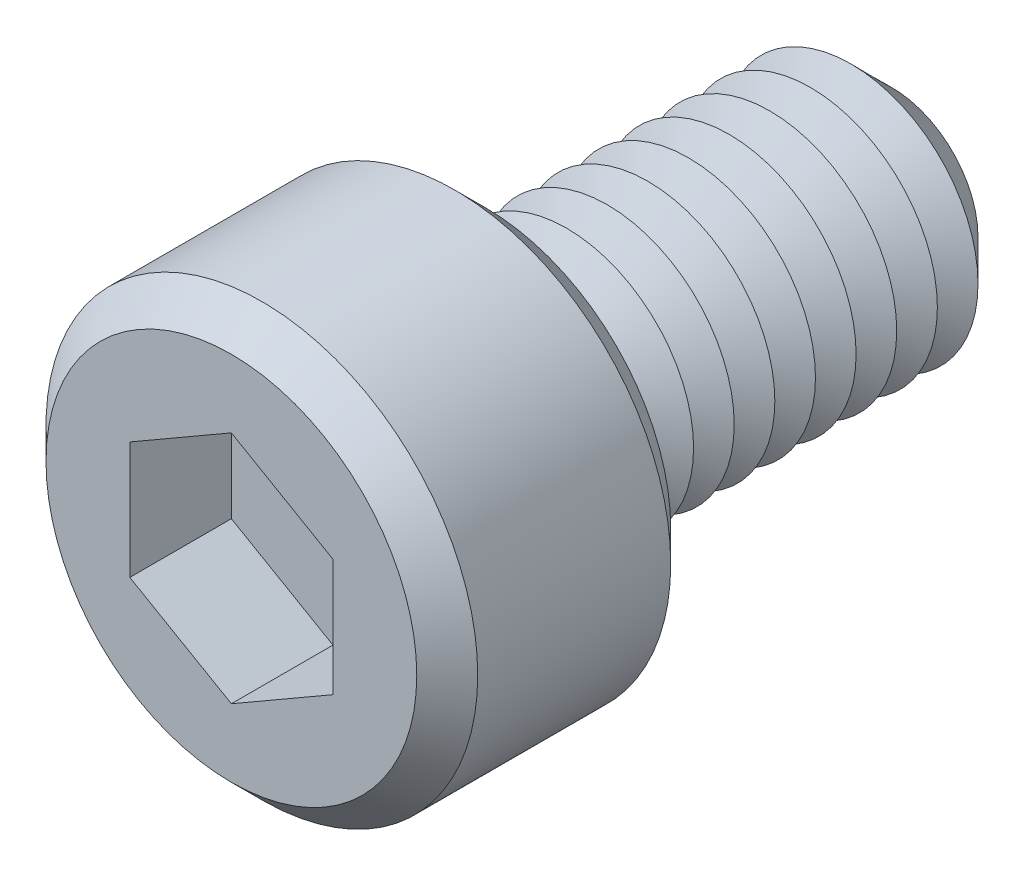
ISO-10303-21;
HEADER;
FILE_DESCRIPTION(('STEP AP214'),'2;1');
FILE_NAME('part.step','',(''),(''),'','','');
FILE_SCHEMA(('AUTOMOTIVE_DESIGN { 1 0 10303 214 1 1 1 1 }'));
ENDSEC;
DATA;
#1=APPLICATION_CONTEXT('core data for automotive mechanical design processes');
#2=APPLICATION_PROTOCOL_DEFINITION('international standard','automotive_design',2000,#1);
#3=PRODUCT_CONTEXT('',#1,'mechanical');
#4=PRODUCT('Part','Part','',(#3));
#5=PRODUCT_RELATED_PRODUCT_CATEGORY('part','',(#4));
#6=PRODUCT_DEFINITION_FORMATION('','',#4);
#7=PRODUCT_DEFINITION_CONTEXT('part definition',#1,'design');
#8=PRODUCT_DEFINITION('design','',#6,#7);
#9=PRODUCT_DEFINITION_SHAPE('','',#8);
#10=(LENGTH_UNIT() NAMED_UNIT(*) SI_UNIT(.MILLI.,.METRE.));
#11=(NAMED_UNIT(*) PLANE_ANGLE_UNIT() SI_UNIT($,.RADIAN.));
#12=(NAMED_UNIT(*) SI_UNIT($,.STERADIAN.) SOLID_ANGLE_UNIT());
#13=UNCERTAINTY_MEASURE_WITH_UNIT(LENGTH_MEASURE(1.E-05),#10,'distance_accuracy_value','');
#14=(GEOMETRIC_REPRESENTATION_CONTEXT(3) GLOBAL_UNCERTAINTY_ASSIGNED_CONTEXT((#13)) GLOBAL_UNIT_ASSIGNED_CONTEXT((#10,
#11,#12)) REPRESENTATION_CONTEXT('',''));
#15=CARTESIAN_POINT('',(0.,0.,0.));
#16=DIRECTION('',(0.,0.,1.));
#17=DIRECTION('',(1.,0.,0.));
#18=AXIS2_PLACEMENT_3D('',#15,#16,#17);
#19=CARTESIAN_POINT('',(0.,0.,5.));
#20=DIRECTION('',(0.,0.,-1.));
#21=DIRECTION('',(-1.,0.,0.));
#22=AXIS2_PLACEMENT_3D('',#19,#20,#21);
#23=CYLINDRICAL_SURFACE('',#22,4.25);
#24=CARTESIAN_POINT('',(0.,0.,0.600000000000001));
#25=DIRECTION('',(0.,0.,1.));
#26=DIRECTION('',(1.,0.,0.));
#27=AXIS2_PLACEMENT_3D('',#24,#25,#26);
#28=CIRCLE('',#27,4.25);
#29=CARTESIAN_POINT('',(4.25,0.,0.600000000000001));
#30=VERTEX_POINT('',#29);
#31=EDGE_CURVE('E248',#30,#30,#28,.T.);
#32=ORIENTED_EDGE('',*,*,#31,.T.);
#33=EDGE_LOOP('',(#32));
#34=FACE_BOUND('',#33,.T.);
#35=CARTESIAN_POINT('',(0.,0.,4.4));
#36=DIRECTION('',(0.,0.,1.));
#37=DIRECTION('',(1.,0.,0.));
#38=AXIS2_PLACEMENT_3D('',#35,#36,#37);
#39=CIRCLE('',#38,4.25);
#40=CARTESIAN_POINT('',(4.25,0.,4.4));
#41=VERTEX_POINT('',#40);
#42=EDGE_CURVE('E244',#41,#41,#39,.F.);
#43=ORIENTED_EDGE('',*,*,#42,.T.);
#44=EDGE_LOOP('',(#43));
#45=FACE_BOUND('',#44,.T.);
#46=ADVANCED_FACE('F39',(#34,#45),#23,.T.);
#47=CARTESIAN_POINT('',(0.,0.,5.));
#48=DIRECTION('',(0.,0.,1.));
#49=DIRECTION('',(1.,0.,0.));
#50=AXIS2_PLACEMENT_3D('',#47,#48,#49);
#51=PLANE('',#50);
#52=CARTESIAN_POINT('',(0.,0.,5.));
#53=DIRECTION('',(0.,0.,1.));
#54=DIRECTION('',(1.,0.,0.));
#55=AXIS2_PLACEMENT_3D('',#52,#53,#54);
#56=CIRCLE('',#55,3.65);
#57=CARTESIAN_POINT('',(3.65,0.,5.));
#58=VERTEX_POINT('',#57);
#59=EDGE_CURVE('E11',#58,#58,#56,.T.);
#60=ORIENTED_EDGE('',*,*,#59,.T.);
#61=EDGE_LOOP('',(#60));
#62=FACE_BOUND('',#61,.T.);
#63=DIRECTION('',(-0.866025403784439,0.5,0.));
#64=VECTOR('',#63,1.);
#65=CARTESIAN_POINT('',(2.,1.15470053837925,5.));
#66=LINE('',#65,#64);
#67=CARTESIAN_POINT('',(2.,1.15470053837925,5.));
#68=VERTEX_POINT('',#67);
#69=CARTESIAN_POINT('',(0.,2.3094010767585,5.));
#70=VERTEX_POINT('',#69);
#71=EDGE_CURVE('E55',#68,#70,#66,.T.);
#72=ORIENTED_EDGE('',*,*,#71,.F.);
#73=DIRECTION('',(0.,1.,0.));
#74=VECTOR('',#73,1.);
#75=CARTESIAN_POINT('',(2.,-1.15470053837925,5.));
#76=LINE('',#75,#74);
#77=CARTESIAN_POINT('',(2.,-1.15470053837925,5.));
#78=VERTEX_POINT('',#77);
#79=EDGE_CURVE('E151',#78,#68,#76,.T.);
#80=ORIENTED_EDGE('',*,*,#79,.F.);
#81=DIRECTION('',(0.866025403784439,0.5,0.));
#82=VECTOR('',#81,1.);
#83=CARTESIAN_POINT('',(0.,-2.3094010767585,5.));
#84=LINE('',#83,#82);
#85=CARTESIAN_POINT('',(0.,-2.3094010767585,5.));
#86=VERTEX_POINT('',#85);
#87=EDGE_CURVE('E148',#86,#78,#84,.T.);
#88=ORIENTED_EDGE('',*,*,#87,.F.);
#89=DIRECTION('',(0.866025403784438,-0.5,0.));
#90=VECTOR('',#89,1.);
#91=CARTESIAN_POINT('',(-2.,-1.15470053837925,5.));
#92=LINE('',#91,#90);
#93=CARTESIAN_POINT('',(-2.,-1.15470053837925,5.));
#94=VERTEX_POINT('',#93);
#95=EDGE_CURVE('E103',#94,#86,#92,.T.);
#96=ORIENTED_EDGE('',*,*,#95,.F.);
#97=DIRECTION('',(0.,-1.,0.));
#98=VECTOR('',#97,1.);
#99=CARTESIAN_POINT('',(-2.,1.15470053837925,5.));
#100=LINE('',#99,#98);
#101=CARTESIAN_POINT('',(-2.,1.15470053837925,5.));
#102=VERTEX_POINT('',#101);
#103=EDGE_CURVE('E142',#102,#94,#100,.T.);
#104=ORIENTED_EDGE('',*,*,#103,.F.);
#105=DIRECTION('',(-0.866025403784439,-0.5,0.));
#106=VECTOR('',#105,1.);
#107=CARTESIAN_POINT('',(0.,2.3094010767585,5.));
#108=LINE('',#107,#106);
#109=EDGE_CURVE('E137',#70,#102,#108,.T.);
#110=ORIENTED_EDGE('',*,*,#109,.F.);
#111=EDGE_LOOP('',(#72,#80,#88,#96,#104,#110));
#112=FACE_BOUND('',#111,.T.);
#113=ADVANCED_FACE('F266',(#62,#112),#51,.T.);
#114=CARTESIAN_POINT('',(0.,0.,0.));
#115=DIRECTION('',(0.,0.,1.));
#116=DIRECTION('',(1.,0.,0.));
#117=AXIS2_PLACEMENT_3D('',#114,#115,#116);
#118=PLANE('',#117);
#119=CARTESIAN_POINT('',(0.,0.,0.));
#120=DIRECTION('',(0.,0.,1.));
#121=DIRECTION('',(1.,0.,0.));
#122=AXIS2_PLACEMENT_3D('',#119,#120,#121);
#123=CIRCLE('',#122,3.65);
#124=CARTESIAN_POINT('',(3.65,0.,0.));
#125=VERTEX_POINT('',#124);
#126=EDGE_CURVE('E48',#125,#125,#123,.F.);
#127=ORIENTED_EDGE('',*,*,#126,.T.);
#128=EDGE_LOOP('',(#127));
#129=FACE_BOUND('',#128,.T.);
#130=CARTESIAN_POINT('',(0.,0.,0.));
#131=DIRECTION('',(0.,0.,1.));
#132=DIRECTION('',(1.,0.,0.));
#133=AXIS2_PLACEMENT_3D('',#130,#131,#132);
#134=CIRCLE('',#133,2.5);
#135=CARTESIAN_POINT('',(2.5,0.,0.));
#136=VERTEX_POINT('',#135);
#137=EDGE_CURVE('E237',#136,#136,#134,.T.);
#138=ORIENTED_EDGE('',*,*,#137,.T.);
#139=EDGE_LOOP('',(#138));
#140=FACE_BOUND('',#139,.T.);
#141=ADVANCED_FACE('F255',(#129,#140),#118,.F.);
#142=CARTESIAN_POINT('',(0.,0.,0.));
#143=DIRECTION('',(0.,0.,1.));
#144=DIRECTION('',(1.,0.,0.));
#145=AXIS2_PLACEMENT_3D('',#142,#143,#144);
#146=CONICAL_SURFACE('',#145,2.5,1.0471975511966);
#147=CARTESIAN_POINT('',(0.,0.,-0.4));
#148=DIRECTION('',(0.,0.,1.));
#149=DIRECTION('',(1.,0.,0.));
#150=AXIS2_PLACEMENT_3D('',#147,#148,#149);
#151=CIRCLE('',#150,1.80717967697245);
#152=CARTESIAN_POINT('',(1.80717967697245,0.,-0.4));
#153=VERTEX_POINT('',#152);
#154=EDGE_CURVE('E233',#153,#153,#151,.T.);
#155=ORIENTED_EDGE('',*,*,#154,.T.);
#156=EDGE_LOOP('',(#155));
#157=FACE_BOUND('',#156,.T.);
#158=ORIENTED_EDGE('',*,*,#137,.F.);
#159=EDGE_LOOP('',(#158));
#160=FACE_BOUND('',#159,.T.);
#161=ADVANCED_FACE('F388',(#157,#160),#146,.T.);
#162=CARTESIAN_POINT('',(0.,0.,-0.4));
#163=DIRECTION('',(0.,0.,-1.));
#164=DIRECTION('',(-1.,0.,0.));
#165=AXIS2_PLACEMENT_3D('',#162,#163,#164);
#166=CONICAL_SURFACE('',#165,1.80717967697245,1.0471975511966);
#167=CARTESIAN_POINT('',(0.,0.,-0.8));
#168=DIRECTION('',(0.,0.,1.));
#169=DIRECTION('',(1.,0.,0.));
#170=AXIS2_PLACEMENT_3D('',#167,#168,#169);
#171=CIRCLE('',#170,2.5);
#172=CARTESIAN_POINT('',(2.5,0.,-0.8));
#173=VERTEX_POINT('',#172);
#174=EDGE_CURVE('E229',#173,#173,#171,.T.);
#175=ORIENTED_EDGE('',*,*,#174,.T.);
#176=EDGE_LOOP('',(#175));
#177=FACE_BOUND('',#176,.T.);
#178=ORIENTED_EDGE('',*,*,#154,.F.);
#179=EDGE_LOOP('',(#178));
#180=FACE_BOUND('',#179,.T.);
#181=ADVANCED_FACE('F384',(#177,#180),#166,.T.);
#182=CARTESIAN_POINT('',(0.,0.,-0.8));
#183=DIRECTION('',(0.,0.,1.));
#184=DIRECTION('',(1.,0.,0.));
#185=AXIS2_PLACEMENT_3D('',#182,#183,#184);
#186=CONICAL_SURFACE('',#185,2.5,1.0471975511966);
#187=CARTESIAN_POINT('',(0.,0.,-1.2));
#188=DIRECTION('',(0.,0.,1.));
#189=DIRECTION('',(1.,0.,0.));
#190=AXIS2_PLACEMENT_3D('',#187,#188,#189);
#191=CIRCLE('',#190,1.80717967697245);
#192=CARTESIAN_POINT('',(1.80717967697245,0.,-1.2));
#193=VERTEX_POINT('',#192);
#194=EDGE_CURVE('E225',#193,#193,#191,.T.);
#195=ORIENTED_EDGE('',*,*,#194,.T.);
#196=EDGE_LOOP('',(#195));
#197=FACE_BOUND('',#196,.T.);
#198=ORIENTED_EDGE('',*,*,#174,.F.);
#199=EDGE_LOOP('',(#198));
#200=FACE_BOUND('',#199,.T.);
#201=ADVANCED_FACE('F380',(#197,#200),#186,.T.);
#202=CARTESIAN_POINT('',(0.,0.,-1.2));
#203=DIRECTION('',(0.,0.,-1.));
#204=DIRECTION('',(-1.,0.,0.));
#205=AXIS2_PLACEMENT_3D('',#202,#203,#204);
#206=CONICAL_SURFACE('',#205,1.80717967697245,1.0471975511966);
#207=CARTESIAN_POINT('',(0.,0.,-1.6));
#208=DIRECTION('',(0.,0.,1.));
#209=DIRECTION('',(1.,0.,0.));
#210=AXIS2_PLACEMENT_3D('',#207,#208,#209);
#211=CIRCLE('',#210,2.5);
#212=CARTESIAN_POINT('',(2.5,0.,-1.6));
#213=VERTEX_POINT('',#212);
#214=EDGE_CURVE('E221',#213,#213,#211,.T.);
#215=ORIENTED_EDGE('',*,*,#214,.T.);
#216=EDGE_LOOP('',(#215));
#217=FACE_BOUND('',#216,.T.);
#218=ORIENTED_EDGE('',*,*,#194,.F.);
#219=EDGE_LOOP('',(#218));
#220=FACE_BOUND('',#219,.T.);
#221=ADVANCED_FACE('F376',(#217,#220),#206,.T.);
#222=CARTESIAN_POINT('',(0.,0.,-1.6));
#223=DIRECTION('',(0.,0.,1.));
#224=DIRECTION('',(1.,0.,0.));
#225=AXIS2_PLACEMENT_3D('',#222,#223,#224);
#226=CONICAL_SURFACE('',#225,2.5,1.0471975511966);
#227=CARTESIAN_POINT('',(0.,0.,-2.));
#228=DIRECTION('',(0.,0.,1.));
#229=DIRECTION('',(1.,0.,0.));
#230=AXIS2_PLACEMENT_3D('',#227,#228,#229);
#231=CIRCLE('',#230,1.80717967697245);
#232=CARTESIAN_POINT('',(1.80717967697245,0.,-2.));
#233=VERTEX_POINT('',#232);
#234=EDGE_CURVE('E217',#233,#233,#231,.T.);
#235=ORIENTED_EDGE('',*,*,#234,.T.);
#236=EDGE_LOOP('',(#235));
#237=FACE_BOUND('',#236,.T.);
#238=ORIENTED_EDGE('',*,*,#214,.F.);
#239=EDGE_LOOP('',(#238));
#240=FACE_BOUND('',#239,.T.);
#241=ADVANCED_FACE('F372',(#237,#240),#226,.T.);
#242=CARTESIAN_POINT('',(0.,0.,-2.));
#243=DIRECTION('',(0.,0.,-1.));
#244=DIRECTION('',(-1.,0.,0.));
#245=AXIS2_PLACEMENT_3D('',#242,#243,#244);
#246=CONICAL_SURFACE('',#245,1.80717967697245,1.0471975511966);
#247=CARTESIAN_POINT('',(0.,0.,-2.4));
#248=DIRECTION('',(0.,0.,1.));
#249=DIRECTION('',(1.,0.,0.));
#250=AXIS2_PLACEMENT_3D('',#247,#248,#249);
#251=CIRCLE('',#250,2.5);
#252=CARTESIAN_POINT('',(2.5,0.,-2.4));
#253=VERTEX_POINT('',#252);
#254=EDGE_CURVE('E213',#253,#253,#251,.T.);
#255=ORIENTED_EDGE('',*,*,#254,.T.);
#256=EDGE_LOOP('',(#255));
#257=FACE_BOUND('',#256,.T.);
#258=ORIENTED_EDGE('',*,*,#234,.F.);
#259=EDGE_LOOP('',(#258));
#260=FACE_BOUND('',#259,.T.);
#261=ADVANCED_FACE('F368',(#257,#260),#246,.T.);
#262=CARTESIAN_POINT('',(0.,0.,-2.4));
#263=DIRECTION('',(0.,0.,1.));
#264=DIRECTION('',(1.,0.,0.));
#265=AXIS2_PLACEMENT_3D('',#262,#263,#264);
#266=CONICAL_SURFACE('',#265,2.5,1.0471975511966);
#267=CARTESIAN_POINT('',(0.,0.,-2.8));
#268=DIRECTION('',(0.,0.,1.));
#269=DIRECTION('',(1.,0.,0.));
#270=AXIS2_PLACEMENT_3D('',#267,#268,#269);
#271=CIRCLE('',#270,1.80717967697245);
#272=CARTESIAN_POINT('',(1.80717967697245,0.,-2.8));
#273=VERTEX_POINT('',#272);
#274=EDGE_CURVE('E209',#273,#273,#271,.T.);
#275=ORIENTED_EDGE('',*,*,#274,.T.);
#276=EDGE_LOOP('',(#275));
#277=FACE_BOUND('',#276,.T.);
#278=ORIENTED_EDGE('',*,*,#254,.F.);
#279=EDGE_LOOP('',(#278));
#280=FACE_BOUND('',#279,.T.);
#281=ADVANCED_FACE('F364',(#277,#280),#266,.T.);
#282=CARTESIAN_POINT('',(0.,0.,-2.8));
#283=DIRECTION('',(0.,0.,-1.));
#284=DIRECTION('',(-1.,0.,0.));
#285=AXIS2_PLACEMENT_3D('',#282,#283,#284);
#286=CONICAL_SURFACE('',#285,1.80717967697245,1.0471975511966);
#287=CARTESIAN_POINT('',(0.,0.,-3.2));
#288=DIRECTION('',(0.,0.,1.));
#289=DIRECTION('',(1.,0.,0.));
#290=AXIS2_PLACEMENT_3D('',#287,#288,#289);
#291=CIRCLE('',#290,2.5);
#292=CARTESIAN_POINT('',(2.5,0.,-3.2));
#293=VERTEX_POINT('',#292);
#294=EDGE_CURVE('E205',#293,#293,#291,.T.);
#295=ORIENTED_EDGE('',*,*,#294,.T.);
#296=EDGE_LOOP('',(#295));
#297=FACE_BOUND('',#296,.T.);
#298=ORIENTED_EDGE('',*,*,#274,.F.);
#299=EDGE_LOOP('',(#298));
#300=FACE_BOUND('',#299,.T.);
#301=ADVANCED_FACE('F360',(#297,#300),#286,.T.);
#302=CARTESIAN_POINT('',(0.,0.,-3.2));
#303=DIRECTION('',(0.,0.,1.));
#304=DIRECTION('',(1.,0.,0.));
#305=AXIS2_PLACEMENT_3D('',#302,#303,#304);
#306=CONICAL_SURFACE('',#305,2.5,1.0471975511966);
#307=CARTESIAN_POINT('',(0.,0.,-3.6));
#308=DIRECTION('',(0.,0.,1.));
#309=DIRECTION('',(1.,0.,0.));
#310=AXIS2_PLACEMENT_3D('',#307,#308,#309);
#311=CIRCLE('',#310,1.80717967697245);
#312=CARTESIAN_POINT('',(1.80717967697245,0.,-3.6));
#313=VERTEX_POINT('',#312);
#314=EDGE_CURVE('E201',#313,#313,#311,.T.);
#315=ORIENTED_EDGE('',*,*,#314,.T.);
#316=EDGE_LOOP('',(#315));
#317=FACE_BOUND('',#316,.T.);
#318=ORIENTED_EDGE('',*,*,#294,.F.);
#319=EDGE_LOOP('',(#318));
#320=FACE_BOUND('',#319,.T.);
#321=ADVANCED_FACE('F356',(#317,#320),#306,.T.);
#322=CARTESIAN_POINT('',(0.,0.,-3.6));
#323=DIRECTION('',(0.,0.,-1.));
#324=DIRECTION('',(-1.,0.,0.));
#325=AXIS2_PLACEMENT_3D('',#322,#323,#324);
#326=CONICAL_SURFACE('',#325,1.80717967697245,1.0471975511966);
#327=CARTESIAN_POINT('',(0.,0.,-4.));
#328=DIRECTION('',(0.,0.,1.));
#329=DIRECTION('',(1.,0.,0.));
#330=AXIS2_PLACEMENT_3D('',#327,#328,#329);
#331=CIRCLE('',#330,2.5);
#332=CARTESIAN_POINT('',(2.5,0.,-4.));
#333=VERTEX_POINT('',#332);
#334=EDGE_CURVE('E198',#333,#333,#331,.T.);
#335=ORIENTED_EDGE('',*,*,#334,.T.);
#336=EDGE_LOOP('',(#335));
#337=FACE_BOUND('',#336,.T.);
#338=ORIENTED_EDGE('',*,*,#314,.F.);
#339=EDGE_LOOP('',(#338));
#340=FACE_BOUND('',#339,.T.);
#341=ADVANCED_FACE('F352',(#337,#340),#326,.T.);
#342=CARTESIAN_POINT('',(0.,0.,-4.));
#343=DIRECTION('',(0.,0.,1.));
#344=DIRECTION('',(1.,0.,0.));
#345=AXIS2_PLACEMENT_3D('',#342,#343,#344);
#346=CONICAL_SURFACE('',#345,2.5,1.0471975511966);
#347=CARTESIAN_POINT('',(0.,0.,-4.4));
#348=DIRECTION('',(0.,0.,1.));
#349=DIRECTION('',(1.,0.,0.));
#350=AXIS2_PLACEMENT_3D('',#347,#348,#349);
#351=CIRCLE('',#350,1.80717967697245);
#352=CARTESIAN_POINT('',(1.80717967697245,0.,-4.4));
#353=VERTEX_POINT('',#352);
#354=EDGE_CURVE('E194',#353,#353,#351,.T.);
#355=ORIENTED_EDGE('',*,*,#354,.T.);
#356=EDGE_LOOP('',(#355));
#357=FACE_BOUND('',#356,.T.);
#358=ORIENTED_EDGE('',*,*,#334,.F.);
#359=EDGE_LOOP('',(#358));
#360=FACE_BOUND('',#359,.T.);
#361=ADVANCED_FACE('F348',(#357,#360),#346,.T.);
#362=CARTESIAN_POINT('',(0.,0.,-4.4));
#363=DIRECTION('',(0.,0.,-1.));
#364=DIRECTION('',(-1.,0.,0.));
#365=AXIS2_PLACEMENT_3D('',#362,#363,#364);
#366=CONICAL_SURFACE('',#365,1.80717967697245,1.0471975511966);
#367=CARTESIAN_POINT('',(0.,0.,-4.8));
#368=DIRECTION('',(0.,0.,1.));
#369=DIRECTION('',(1.,0.,0.));
#370=AXIS2_PLACEMENT_3D('',#367,#368,#369);
#371=CIRCLE('',#370,2.5);
#372=CARTESIAN_POINT('',(2.5,0.,-4.8));
#373=VERTEX_POINT('',#372);
#374=EDGE_CURVE('E190',#373,#373,#371,.T.);
#375=ORIENTED_EDGE('',*,*,#374,.T.);
#376=EDGE_LOOP('',(#375));
#377=FACE_BOUND('',#376,.T.);
#378=ORIENTED_EDGE('',*,*,#354,.F.);
#379=EDGE_LOOP('',(#378));
#380=FACE_BOUND('',#379,.T.);
#381=ADVANCED_FACE('F344',(#377,#380),#366,.T.);
#382=CARTESIAN_POINT('',(0.,0.,-4.8));
#383=DIRECTION('',(0.,0.,1.));
#384=DIRECTION('',(1.,0.,0.));
#385=AXIS2_PLACEMENT_3D('',#382,#383,#384);
#386=CONICAL_SURFACE('',#385,2.5,1.0471975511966);
#387=CARTESIAN_POINT('',(0.,0.,-5.2));
#388=DIRECTION('',(0.,0.,1.));
#389=DIRECTION('',(1.,0.,0.));
#390=AXIS2_PLACEMENT_3D('',#387,#388,#389);
#391=CIRCLE('',#390,1.80717967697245);
#392=CARTESIAN_POINT('',(1.80717967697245,0.,-5.2));
#393=VERTEX_POINT('',#392);
#394=EDGE_CURVE('E186',#393,#393,#391,.T.);
#395=ORIENTED_EDGE('',*,*,#394,.T.);
#396=EDGE_LOOP('',(#395));
#397=FACE_BOUND('',#396,.T.);
#398=ORIENTED_EDGE('',*,*,#374,.F.);
#399=EDGE_LOOP('',(#398));
#400=FACE_BOUND('',#399,.T.);
#401=ADVANCED_FACE('F340',(#397,#400),#386,.T.);
#402=CARTESIAN_POINT('',(0.,0.,-5.2));
#403=DIRECTION('',(0.,0.,-1.));
#404=DIRECTION('',(-1.,0.,0.));
#405=AXIS2_PLACEMENT_3D('',#402,#403,#404);
#406=CONICAL_SURFACE('',#405,1.80717967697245,1.0471975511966);
#407=CARTESIAN_POINT('',(0.,0.,-5.6));
#408=DIRECTION('',(0.,0.,1.));
#409=DIRECTION('',(1.,0.,0.));
#410=AXIS2_PLACEMENT_3D('',#407,#408,#409);
#411=CIRCLE('',#410,2.5);
#412=CARTESIAN_POINT('',(2.5,0.,-5.6));
#413=VERTEX_POINT('',#412);
#414=EDGE_CURVE('E182',#413,#413,#411,.T.);
#415=ORIENTED_EDGE('',*,*,#414,.T.);
#416=EDGE_LOOP('',(#415));
#417=FACE_BOUND('',#416,.T.);
#418=ORIENTED_EDGE('',*,*,#394,.F.);
#419=EDGE_LOOP('',(#418));
#420=FACE_BOUND('',#419,.T.);
#421=ADVANCED_FACE('F336',(#417,#420),#406,.T.);
#422=CARTESIAN_POINT('',(0.,0.,-5.6));
#423=DIRECTION('',(0.,0.,1.));
#424=DIRECTION('',(1.,0.,0.));
#425=AXIS2_PLACEMENT_3D('',#422,#423,#424);
#426=CONICAL_SURFACE('',#425,2.5,1.0471975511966);
#427=CARTESIAN_POINT('',(0.,0.,-6.));
#428=DIRECTION('',(0.,0.,1.));
#429=DIRECTION('',(1.,0.,0.));
#430=AXIS2_PLACEMENT_3D('',#427,#428,#429);
#431=CIRCLE('',#430,1.80717967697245);
#432=CARTESIAN_POINT('',(1.80717967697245,0.,-6.));
#433=VERTEX_POINT('',#432);
#434=EDGE_CURVE('E178',#433,#433,#431,.T.);
#435=ORIENTED_EDGE('',*,*,#434,.T.);
#436=EDGE_LOOP('',(#435));
#437=FACE_BOUND('',#436,.T.);
#438=ORIENTED_EDGE('',*,*,#414,.F.);
#439=EDGE_LOOP('',(#438));
#440=FACE_BOUND('',#439,.T.);
#441=ADVANCED_FACE('F332',(#437,#440),#426,.T.);
#442=CARTESIAN_POINT('',(0.,0.,-6.));
#443=DIRECTION('',(0.,0.,-1.));
#444=DIRECTION('',(-1.,0.,0.));
#445=AXIS2_PLACEMENT_3D('',#442,#443,#444);
#446=CONICAL_SURFACE('',#445,1.80717967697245,1.0471975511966);
#447=CARTESIAN_POINT('',(0.,0.,-6.4));
#448=DIRECTION('',(0.,0.,1.));
#449=DIRECTION('',(1.,0.,0.));
#450=AXIS2_PLACEMENT_3D('',#447,#448,#449);
#451=CIRCLE('',#450,2.5);
#452=CARTESIAN_POINT('',(2.5,0.,-6.4));
#453=VERTEX_POINT('',#452);
#454=EDGE_CURVE('E174',#453,#453,#451,.T.);
#455=ORIENTED_EDGE('',*,*,#454,.T.);
#456=EDGE_LOOP('',(#455));
#457=FACE_BOUND('',#456,.T.);
#458=ORIENTED_EDGE('',*,*,#434,.F.);
#459=EDGE_LOOP('',(#458));
#460=FACE_BOUND('',#459,.T.);
#461=ADVANCED_FACE('F328',(#457,#460),#446,.T.);
#462=CARTESIAN_POINT('',(0.,0.,-6.4));
#463=DIRECTION('',(0.,0.,1.));
#464=DIRECTION('',(1.,0.,0.));
#465=AXIS2_PLACEMENT_3D('',#462,#463,#464);
#466=CONICAL_SURFACE('',#465,2.5,1.0471975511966);
#467=CARTESIAN_POINT('',(0.,0.,-6.8));
#468=DIRECTION('',(0.,0.,1.));
#469=DIRECTION('',(1.,0.,0.));
#470=AXIS2_PLACEMENT_3D('',#467,#468,#469);
#471=CIRCLE('',#470,1.80717967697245);
#472=CARTESIAN_POINT('',(1.80717967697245,0.,-6.8));
#473=VERTEX_POINT('',#472);
#474=EDGE_CURVE('E170',#473,#473,#471,.T.);
#475=ORIENTED_EDGE('',*,*,#474,.T.);
#476=EDGE_LOOP('',(#475));
#477=FACE_BOUND('',#476,.T.);
#478=ORIENTED_EDGE('',*,*,#454,.F.);
#479=EDGE_LOOP('',(#478));
#480=FACE_BOUND('',#479,.T.);
#481=ADVANCED_FACE('F324',(#477,#480),#466,.T.);
#482=CARTESIAN_POINT('',(0.,0.,-6.8));
#483=DIRECTION('',(0.,0.,-1.));
#484=DIRECTION('',(-1.,0.,0.));
#485=AXIS2_PLACEMENT_3D('',#482,#483,#484);
#486=CONICAL_SURFACE('',#485,1.80717967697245,1.0471975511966);
#487=CARTESIAN_POINT('',(0.,0.,-7.2));
#488=DIRECTION('',(0.,0.,1.));
#489=DIRECTION('',(1.,0.,0.));
#490=AXIS2_PLACEMENT_3D('',#487,#488,#489);
#491=CIRCLE('',#490,2.5);
#492=CARTESIAN_POINT('',(2.5,0.,-7.2));
#493=VERTEX_POINT('',#492);
#494=EDGE_CURVE('E157',#493,#493,#491,.T.);
#495=ORIENTED_EDGE('',*,*,#494,.T.);
#496=EDGE_LOOP('',(#495));
#497=FACE_BOUND('',#496,.T.);
#498=ORIENTED_EDGE('',*,*,#474,.F.);
#499=EDGE_LOOP('',(#498));
#500=FACE_BOUND('',#499,.T.);
#501=ADVANCED_FACE('F320',(#497,#500),#486,.T.);
#502=CARTESIAN_POINT('',(0.,0.,-8.));
#503=DIRECTION('',(0.,0.,-1.));
#504=DIRECTION('',(-1.,0.,0.));
#505=AXIS2_PLACEMENT_3D('',#502,#503,#504);
#506=PLANE('',#505);
#507=CARTESIAN_POINT('',(0.,0.,-8.));
#508=DIRECTION('',(0.,0.,-1.));
#509=DIRECTION('',(-1.,0.,0.));
#510=AXIS2_PLACEMENT_3D('',#507,#508,#509);
#511=CIRCLE('',#510,0.65);
#512=CARTESIAN_POINT('',(-0.65,0.,-8.));
#513=VERTEX_POINT('',#512);
#514=EDGE_CURVE('E138',#513,#513,#511,.F.);
#515=ORIENTED_EDGE('',*,*,#514,.T.);
#516=EDGE_LOOP('',(#515));
#517=FACE_BOUND('',#516,.T.);
#518=CARTESIAN_POINT('',(0.,0.,-8.));
#519=DIRECTION('',(0.,0.,-1.));
#520=DIRECTION('',(-1.,0.,0.));
#521=AXIS2_PLACEMENT_3D('',#518,#519,#520);
#522=CIRCLE('',#521,1.7);
#523=CARTESIAN_POINT('',(1.7,0.,-8.));
#524=VERTEX_POINT('',#523);
#525=EDGE_CURVE('E241',#524,#524,#522,.T.);
#526=ORIENTED_EDGE('',*,*,#525,.T.);
#527=EDGE_LOOP('',(#526));
#528=FACE_BOUND('',#527,.T.);
#529=ADVANCED_FACE('F323',(#517,#528),#506,.T.);
#530=CARTESIAN_POINT('',(0.,0.,-8.));
#531=DIRECTION('',(0.,0.,1.));
#532=DIRECTION('',(1.,0.,0.));
#533=AXIS2_PLACEMENT_3D('',#530,#531,#532);
#534=CONICAL_SURFACE('',#533,1.7,0.785398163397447);
#535=CARTESIAN_POINT('',(2.5,0.,-7.2));
#536=CARTESIAN_POINT('',(2.49166666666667,0.,-7.20833333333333));
#537=CARTESIAN_POINT('',(2.48333333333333,0.,-7.21666666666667));
#538=CARTESIAN_POINT('',(2.46666666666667,0.,-7.23333333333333));
#539=CARTESIAN_POINT('',(2.45833333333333,0.,-7.24166666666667));
#540=CARTESIAN_POINT('',(2.44166666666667,0.,-7.25833333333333));
#541=CARTESIAN_POINT('',(2.43333333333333,0.,-7.26666666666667));
#542=CARTESIAN_POINT('',(2.41666666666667,0.,-7.28333333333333));
#543=CARTESIAN_POINT('',(2.40833333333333,0.,-7.29166666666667));
#544=CARTESIAN_POINT('',(2.39166666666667,0.,-7.30833333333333));
#545=CARTESIAN_POINT('',(2.38333333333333,0.,-7.31666666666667));
#546=CARTESIAN_POINT('',(2.36666666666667,0.,-7.33333333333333));
#547=CARTESIAN_POINT('',(2.35833333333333,0.,-7.34166666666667));
#548=CARTESIAN_POINT('',(2.34166666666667,0.,-7.35833333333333));
#549=CARTESIAN_POINT('',(2.33333333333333,0.,-7.36666666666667));
#550=CARTESIAN_POINT('',(2.31666666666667,0.,-7.38333333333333));
#551=CARTESIAN_POINT('',(2.30833333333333,0.,-7.39166666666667));
#552=CARTESIAN_POINT('',(2.29166666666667,0.,-7.40833333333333));
#553=CARTESIAN_POINT('',(2.28333333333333,0.,-7.41666666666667));
#554=CARTESIAN_POINT('',(2.26666666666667,0.,-7.43333333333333));
#555=CARTESIAN_POINT('',(2.25833333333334,0.,-7.44166666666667));
#556=CARTESIAN_POINT('',(2.24166666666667,0.,-7.45833333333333));
#557=CARTESIAN_POINT('',(2.23333333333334,0.,-7.46666666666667));
#558=CARTESIAN_POINT('',(2.21666666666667,0.,-7.48333333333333));
#559=CARTESIAN_POINT('',(2.20833333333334,0.,-7.49166666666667));
#560=CARTESIAN_POINT('',(2.19166666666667,0.,-7.50833333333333));
#561=CARTESIAN_POINT('',(2.18333333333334,0.,-7.51666666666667));
#562=CARTESIAN_POINT('',(2.16666666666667,0.,-7.53333333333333));
#563=CARTESIAN_POINT('',(2.15833333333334,0.,-7.54166666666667));
#564=CARTESIAN_POINT('',(2.14166666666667,0.,-7.55833333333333));
#565=CARTESIAN_POINT('',(2.13333333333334,0.,-7.56666666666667));
#566=CARTESIAN_POINT('',(2.11666666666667,0.,-7.58333333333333));
#567=CARTESIAN_POINT('',(2.10833333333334,0.,-7.59166666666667));
#568=CARTESIAN_POINT('',(2.09166666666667,0.,-7.60833333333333));
#569=CARTESIAN_POINT('',(2.08333333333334,0.,-7.61666666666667));
#570=CARTESIAN_POINT('',(2.06666666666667,0.,-7.63333333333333));
#571=CARTESIAN_POINT('',(2.05833333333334,0.,-7.64166666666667));
#572=CARTESIAN_POINT('',(2.04166666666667,0.,-7.65833333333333));
#573=CARTESIAN_POINT('',(2.03333333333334,0.,-7.66666666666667));
#574=CARTESIAN_POINT('',(2.01666666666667,0.,-7.68333333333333));
#575=CARTESIAN_POINT('',(2.00833333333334,0.,-7.69166666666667));
#576=CARTESIAN_POINT('',(1.99166666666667,0.,-7.70833333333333));
#577=CARTESIAN_POINT('',(1.98333333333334,0.,-7.71666666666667));
#578=CARTESIAN_POINT('',(1.96666666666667,0.,-7.73333333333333));
#579=CARTESIAN_POINT('',(1.95833333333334,0.,-7.74166666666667));
#580=CARTESIAN_POINT('',(1.94166666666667,0.,-7.75833333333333));
#581=CARTESIAN_POINT('',(1.93333333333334,0.,-7.76666666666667));
#582=CARTESIAN_POINT('',(1.91666666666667,0.,-7.78333333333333));
#583=CARTESIAN_POINT('',(1.90833333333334,0.,-7.79166666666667));
#584=CARTESIAN_POINT('',(1.89166666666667,0.,-7.80833333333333));
#585=CARTESIAN_POINT('',(1.88333333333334,0.,-7.81666666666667));
#586=CARTESIAN_POINT('',(1.86666666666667,0.,-7.83333333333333));
#587=CARTESIAN_POINT('',(1.85833333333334,0.,-7.84166666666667));
#588=CARTESIAN_POINT('',(1.84166666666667,0.,-7.85833333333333));
#589=CARTESIAN_POINT('',(1.83333333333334,0.,-7.86666666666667));
#590=CARTESIAN_POINT('',(1.81666666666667,0.,-7.88333333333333));
#591=CARTESIAN_POINT('',(1.80833333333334,0.,-7.89166666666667));
#592=CARTESIAN_POINT('',(1.79166666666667,0.,-7.90833333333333));
#593=CARTESIAN_POINT('',(1.78333333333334,0.,-7.91666666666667));
#594=CARTESIAN_POINT('',(1.76666666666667,0.,-7.93333333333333));
#595=CARTESIAN_POINT('',(1.75833333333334,0.,-7.94166666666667));
#596=CARTESIAN_POINT('',(1.74166666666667,0.,-7.95833333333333));
#597=CARTESIAN_POINT('',(1.73333333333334,0.,-7.96666666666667));
#598=CARTESIAN_POINT('',(1.71666666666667,0.,-7.98333333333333));
#599=CARTESIAN_POINT('',(1.70833333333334,0.,-7.99166666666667));
#600=CARTESIAN_POINT('',(1.7,0.,-8.));
#601=B_SPLINE_CURVE_WITH_KNOTS('',3,(#535,#536,#537,#538,#539,#540,#541,#542,#543,#544,#545,
#546,#547,#548,#549,#550,#551,#552,#553,#554,#555,#556,#557,#558,#559,#560,#561,#562,#563,#564,
#565,#566,#567,#568,#569,#570,#571,#572,#573,#574,#575,#576,#577,#578,#579,#580,#581,#582,#583,
#584,#585,#586,#587,#588,#589,#590,#591,#592,#593,#594,#595,#596,#597,#598,#599,#600),
.UNSPECIFIED.,.F.,.F.,(4,2,2,2,2,2,2,2,2,2,2,2,2,2,2,2,2,2,2,2,2,2,2,2,2,2,2,2,2,2,2,2,4),(0.,
0.0353553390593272,0.0707106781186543,0.106066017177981,0.141421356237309,0.176776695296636,
0.212132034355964,0.247487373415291,0.282842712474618,0.318198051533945,0.353553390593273,
0.3889087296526,0.424264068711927,0.459619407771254,0.494974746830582,0.530330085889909,
0.565685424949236,0.601040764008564,0.636396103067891,0.671751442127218,0.707106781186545,
0.742462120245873,0.7778174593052,0.813172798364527,0.848528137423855,0.883883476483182,
0.919238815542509,0.954594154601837,0.989949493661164,1.02530483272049,1.06066017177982,
1.09601551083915,1.13137084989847),.UNSPECIFIED.);
#602=EDGE_CURVE('BSEAM319',#493,#524,#601,.T.);
#603=ORIENTED_EDGE('',*,*,#494,.F.);
#604=ORIENTED_EDGE('',*,*,#525,.F.);
#605=ORIENTED_EDGE('',*,*,#602,.T.);
#606=ORIENTED_EDGE('',*,*,#602,.F.);
#607=EDGE_LOOP('',(#603,#605,#604,#606));
#608=FACE_BOUND('',#607,.T.);
#609=ADVANCED_FACE('F319',(#608),#534,.T.);
#610=CARTESIAN_POINT('',(2.,1.15470053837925,3.));
#611=DIRECTION('',(0.5,0.866025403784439,0.));
#612=DIRECTION('',(-0.866025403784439,0.5,0.));
#613=AXIS2_PLACEMENT_3D('',#610,#611,#612);
#614=PLANE('',#613);
#615=ORIENTED_EDGE('',*,*,#71,.T.);
#616=DIRECTION('',(0.,0.,1.));
#617=VECTOR('',#616,1.);
#618=CARTESIAN_POINT('',(0.,2.3094010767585,3.));
#619=LINE('',#618,#617);
#620=CARTESIAN_POINT('',(0.,2.3094010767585,3.));
#621=VERTEX_POINT('',#620);
#622=EDGE_CURVE('E85',#621,#70,#619,.T.);
#623=ORIENTED_EDGE('',*,*,#622,.F.);
#624=DIRECTION('',(-0.866025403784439,0.5,0.));
#625=VECTOR('',#624,1.);
#626=CARTESIAN_POINT('',(2.,1.15470053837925,3.));
#627=LINE('',#626,#625);
#628=CARTESIAN_POINT('',(2.,1.15470053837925,3.));
#629=VERTEX_POINT('',#628);
#630=EDGE_CURVE('E154',#629,#621,#627,.T.);
#631=ORIENTED_EDGE('',*,*,#630,.F.);
#632=DIRECTION('',(0.,0.,1.));
#633=VECTOR('',#632,1.);
#634=CARTESIAN_POINT('',(2.,1.15470053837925,3.));
#635=LINE('',#634,#633);
#636=EDGE_CURVE('E63',#629,#68,#635,.T.);
#637=ORIENTED_EDGE('',*,*,#636,.T.);
#638=EDGE_LOOP('',(#615,#623,#631,#637));
#639=FACE_BOUND('',#638,.T.);
#640=ADVANCED_FACE('F309',(#639),#614,.F.);
#641=CARTESIAN_POINT('',(2.,-1.15470053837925,3.));
#642=DIRECTION('',(1.,0.,0.));
#643=DIRECTION('',(0.,0.,-1.));
#644=AXIS2_PLACEMENT_3D('',#641,#642,#643);
#645=PLANE('',#644);
#646=ORIENTED_EDGE('',*,*,#79,.T.);
#647=ORIENTED_EDGE('',*,*,#636,.F.);
#648=DIRECTION('',(0.,1.,0.));
#649=VECTOR('',#648,1.);
#650=CARTESIAN_POINT('',(2.,-1.15470053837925,3.));
#651=LINE('',#650,#649);
#652=CARTESIAN_POINT('',(2.,-1.15470053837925,3.));
#653=VERTEX_POINT('',#652);
#654=EDGE_CURVE('E117',#653,#629,#651,.T.);
#655=ORIENTED_EDGE('',*,*,#654,.F.);
#656=DIRECTION('',(0.,0.,1.));
#657=VECTOR('',#656,1.);
#658=CARTESIAN_POINT('',(2.,-1.15470053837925,3.));
#659=LINE('',#658,#657);
#660=EDGE_CURVE('E108',#653,#78,#659,.T.);
#661=ORIENTED_EDGE('',*,*,#660,.T.);
#662=EDGE_LOOP('',(#646,#647,#655,#661));
#663=FACE_BOUND('',#662,.T.);
#664=ADVANCED_FACE('F306',(#663),#645,.F.);
#665=CARTESIAN_POINT('',(0.,-2.3094010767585,3.));
#666=DIRECTION('',(0.5,-0.866025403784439,0.));
#667=DIRECTION('',(0.866025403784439,0.5,0.));
#668=AXIS2_PLACEMENT_3D('',#665,#666,#667);
#669=PLANE('',#668);
#670=ORIENTED_EDGE('',*,*,#87,.T.);
#671=ORIENTED_EDGE('',*,*,#660,.F.);
#672=DIRECTION('',(0.866025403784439,0.5,0.));
#673=VECTOR('',#672,1.);
#674=CARTESIAN_POINT('',(0.,-2.3094010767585,3.));
#675=LINE('',#674,#673);
#676=CARTESIAN_POINT('',(0.,-2.3094010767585,3.));
#677=VERTEX_POINT('',#676);
#678=EDGE_CURVE('E112',#677,#653,#675,.T.);
#679=ORIENTED_EDGE('',*,*,#678,.F.);
#680=DIRECTION('',(0.,0.,1.));
#681=VECTOR('',#680,1.);
#682=CARTESIAN_POINT('',(0.,-2.3094010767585,3.));
#683=LINE('',#682,#681);
#684=EDGE_CURVE('E96',#677,#86,#683,.T.);
#685=ORIENTED_EDGE('',*,*,#684,.T.);
#686=EDGE_LOOP('',(#670,#671,#679,#685));
#687=FACE_BOUND('',#686,.T.);
#688=ADVANCED_FACE('F113',(#687),#669,.F.);
#689=CARTESIAN_POINT('',(-2.,-1.15470053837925,3.));
#690=DIRECTION('',(-0.5,-0.866025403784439,0.));
#691=DIRECTION('',(0.866025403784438,-0.5,0.));
#692=AXIS2_PLACEMENT_3D('',#689,#690,#691);
#693=PLANE('',#692);
#694=ORIENTED_EDGE('',*,*,#95,.T.);
#695=ORIENTED_EDGE('',*,*,#684,.F.);
#696=DIRECTION('',(0.866025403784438,-0.5,0.));
#697=VECTOR('',#696,1.);
#698=CARTESIAN_POINT('',(-2.,-1.15470053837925,3.));
#699=LINE('',#698,#697);
#700=CARTESIAN_POINT('',(-2.,-1.15470053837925,3.));
#701=VERTEX_POINT('',#700);
#702=EDGE_CURVE('E100',#701,#677,#699,.T.);
#703=ORIENTED_EDGE('',*,*,#702,.F.);
#704=DIRECTION('',(0.,0.,1.));
#705=VECTOR('',#704,1.);
#706=CARTESIAN_POINT('',(-2.,-1.15470053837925,3.));
#707=LINE('',#706,#705);
#708=EDGE_CURVE('E109',#701,#94,#707,.T.);
#709=ORIENTED_EDGE('',*,*,#708,.T.);
#710=EDGE_LOOP('',(#694,#695,#703,#709));
#711=FACE_BOUND('',#710,.T.);
#712=ADVANCED_FACE('F98',(#711),#693,.F.);
#713=CARTESIAN_POINT('',(-2.,1.15470053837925,3.));
#714=DIRECTION('',(-1.,0.,0.));
#715=DIRECTION('',(0.,-1.,0.));
#716=AXIS2_PLACEMENT_3D('',#713,#714,#715);
#717=PLANE('',#716);
#718=ORIENTED_EDGE('',*,*,#103,.T.);
#719=ORIENTED_EDGE('',*,*,#708,.F.);
#720=DIRECTION('',(0.,-1.,0.));
#721=VECTOR('',#720,1.);
#722=CARTESIAN_POINT('',(-2.,1.15470053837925,3.));
#723=LINE('',#722,#721);
#724=CARTESIAN_POINT('',(-2.,1.15470053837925,3.));
#725=VERTEX_POINT('',#724);
#726=EDGE_CURVE('E123',#725,#701,#723,.T.);
#727=ORIENTED_EDGE('',*,*,#726,.F.);
#728=DIRECTION('',(0.,0.,1.));
#729=VECTOR('',#728,1.);
#730=CARTESIAN_POINT('',(-2.,1.15470053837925,3.));
#731=LINE('',#730,#729);
#732=EDGE_CURVE('E162',#725,#102,#731,.T.);
#733=ORIENTED_EDGE('',*,*,#732,.T.);
#734=EDGE_LOOP('',(#718,#719,#727,#733));
#735=FACE_BOUND('',#734,.T.);
#736=ADVANCED_FACE('F303',(#735),#717,.F.);
#737=CARTESIAN_POINT('',(0.,2.3094010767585,3.));
#738=DIRECTION('',(-0.5,0.866025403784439,0.));
#739=DIRECTION('',(-0.866025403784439,-0.5,0.));
#740=AXIS2_PLACEMENT_3D('',#737,#738,#739);
#741=PLANE('',#740);
#742=ORIENTED_EDGE('',*,*,#109,.T.);
#743=ORIENTED_EDGE('',*,*,#732,.F.);
#744=DIRECTION('',(-0.866025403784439,-0.5,0.));
#745=VECTOR('',#744,1.);
#746=CARTESIAN_POINT('',(0.,2.3094010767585,3.));
#747=LINE('',#746,#745);
#748=EDGE_CURVE('E129',#621,#725,#747,.T.);
#749=ORIENTED_EDGE('',*,*,#748,.F.);
#750=ORIENTED_EDGE('',*,*,#622,.T.);
#751=EDGE_LOOP('',(#742,#743,#749,#750));
#752=FACE_BOUND('',#751,.T.);
#753=ADVANCED_FACE('F281',(#752),#741,.F.);
#754=CARTESIAN_POINT('',(0.,0.,3.));
#755=DIRECTION('',(0.,0.,1.));
#756=DIRECTION('',(1.,0.,0.));
#757=AXIS2_PLACEMENT_3D('',#754,#755,#756);
#758=PLANE('',#757);
#759=CARTESIAN_POINT('',(0.,0.,3.));
#760=DIRECTION('',(0.,0.,1.));
#761=DIRECTION('',(1.,0.,0.));
#762=AXIS2_PLACEMENT_3D('',#759,#760,#761);
#763=CIRCLE('',#762,0.65);
#764=CARTESIAN_POINT('',(0.65,0.,3.));
#765=VERTEX_POINT('',#764);
#766=EDGE_CURVE('E289',#765,#765,#763,.T.);
#767=ORIENTED_EDGE('',*,*,#766,.F.);
#768=EDGE_LOOP('',(#767));
#769=FACE_BOUND('',#768,.T.);
#770=ORIENTED_EDGE('',*,*,#630,.T.);
#771=ORIENTED_EDGE('',*,*,#748,.T.);
#772=ORIENTED_EDGE('',*,*,#726,.T.);
#773=ORIENTED_EDGE('',*,*,#702,.T.);
#774=ORIENTED_EDGE('',*,*,#678,.T.);
#775=ORIENTED_EDGE('',*,*,#654,.T.);
#776=EDGE_LOOP('',(#770,#771,#772,#773,#774,#775));
#777=FACE_BOUND('',#776,.T.);
#778=ADVANCED_FACE('F120',(#769,#777),#758,.T.);
#779=CARTESIAN_POINT('',(0.,0.,-9.83847763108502));
#780=DIRECTION('',(0.,0.,1.));
#781=DIRECTION('',(1.,0.,0.));
#782=AXIS2_PLACEMENT_3D('',#779,#780,#781);
#783=CYLINDRICAL_SURFACE('',#782,0.65);
#784=ORIENTED_EDGE('',*,*,#766,.T.);
#785=EDGE_LOOP('',(#784));
#786=FACE_BOUND('',#785,.T.);
#787=ORIENTED_EDGE('',*,*,#514,.F.);
#788=EDGE_LOOP('',(#787));
#789=FACE_BOUND('',#788,.T.);
#790=ADVANCED_FACE('F261',(#786,#789),#783,.F.);
#791=CARTESIAN_POINT('',(0.,0.,0.600000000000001));
#792=DIRECTION('',(0.,0.,1.));
#793=DIRECTION('',(1.,0.,0.));
#794=AXIS2_PLACEMENT_3D('',#791,#792,#793);
#795=CONICAL_SURFACE('',#794,4.25,0.78539816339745);
#796=ORIENTED_EDGE('',*,*,#126,.F.);
#797=EDGE_LOOP('',(#796));
#798=FACE_BOUND('',#797,.T.);
#799=ORIENTED_EDGE('',*,*,#31,.F.);
#800=EDGE_LOOP('',(#799));
#801=FACE_BOUND('',#800,.T.);
#802=ADVANCED_FACE('F258',(#798,#801),#795,.T.);
#803=CARTESIAN_POINT('',(0.,0.,5.));
#804=DIRECTION('',(0.,0.,-1.));
#805=DIRECTION('',(-1.,0.,0.));
#806=AXIS2_PLACEMENT_3D('',#803,#804,#805);
#807=CONICAL_SURFACE('',#806,3.65,0.785398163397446);
#808=ORIENTED_EDGE('',*,*,#42,.F.);
#809=EDGE_LOOP('',(#808));
#810=FACE_BOUND('',#809,.T.);
#811=ORIENTED_EDGE('',*,*,#59,.F.);
#812=EDGE_LOOP('',(#811));
#813=FACE_BOUND('',#812,.T.);
#814=ADVANCED_FACE('F41',(#810,#813),#807,.T.);
#815=CLOSED_SHELL('',(#46,#113,#141,#161,#181,#201,#221,#241,#261,#281,#301,#321,#341,#361,#381,
#401,#421,#441,#461,#481,#501,#529,#609,#640,#664,#688,#712,#736,#753,#778,#790,#802,#814));
#816=MANIFOLD_SOLID_BREP('B2',#815);
#817=ADVANCED_BREP_SHAPE_REPRESENTATION('',(#18,#816),#14);
#818=SHAPE_DEFINITION_REPRESENTATION(#9,#817);
ENDSEC;
END-ISO-10303-21;
